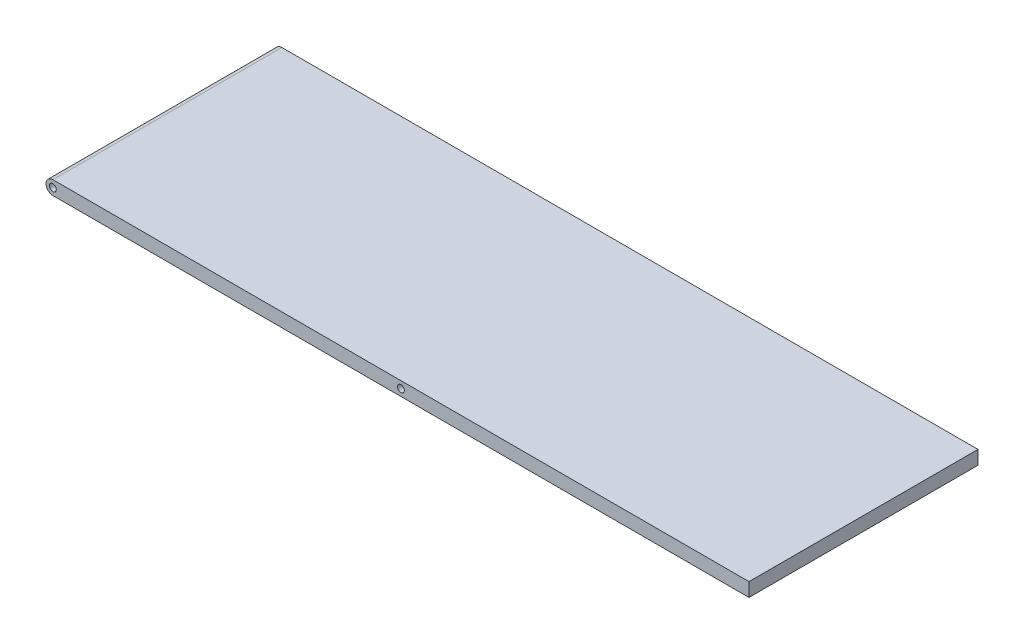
from build123d import *

# Parameters (mm, degrees)
BASE_EXTRUSION_DEPTH    = 50
ESQUISSE2_R             = 0.75
ENL_V_MAT_EXTRU_1_DEPTH = 10


with BuildPart() as part:
    # Esquisse1 → Base-Extrusion (new body)
    with BuildSketch(Plane.XY):
        with BuildLine():
            Line((0, 1.5), (152, 1.5))
            Line((152, 1.5), (152, -1.5))
            Line((152, -1.5), (0, -1.5))
            ThreePointArc((0, -1.5), (-1.5, 0), (0, 1.5))
        make_face()
    extrude(amount=BASE_EXTRUSION_DEPTH)

    # Esquisse2 → Enl_v. mat.-Extru.1 (cut)
    with BuildSketch(Plane.XY.offset(50)):
        Circle(ESQUISSE2_R)
        with Locations((76, 0)):
            Circle(ESQUISSE2_R)
    extrude(amount=-ENL_V_MAT_EXTRU_1_DEPTH, mode=Mode.SUBTRACT)


solid = part.part
